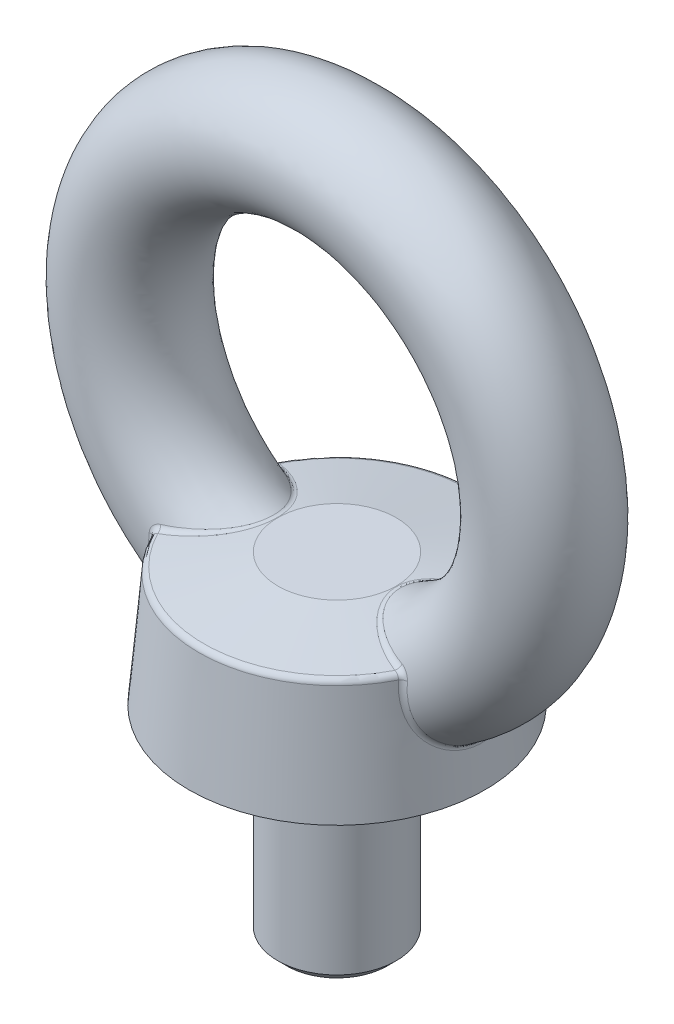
from build123d import *

# Parameters (mm, degrees)
SKETCH2_R      = 5
FILLET1_R      = 0.5
SKETCH4_R      = 5
EXTRUDE1_DEPTH = 17
CHAMFER1_SIZE  = 0.75


with BuildPart() as part:
    # Sweep1: sweep along a path in Sketch1
    with BuildLine(Plane.XY) as sweep1_path:
        EllipticalCenterArc((0, 22.5), 22.5, 22.5, start_angle=0, arc_size=360, rotation=-90)
    # Sketch2 → Sweep1 (sweep)
    with BuildSketch(Plane(origin=(0, 0, 0), x_dir=(0, 0, -1), z_dir=(1, 0, 0))):
        with Locations((0, 5)):
            Circle(SKETCH2_R)
    sweep(path=sweep1_path.line)

    # Sketch3 → Revolve1 (revolve)
    with BuildSketch(Plane(origin=(0, 0, 0), x_dir=(0, 0, -1), z_dir=(1, 0, 0)), mode=Mode.PRIVATE) as revolve1_sk:
        Polygon((0, 0), (-12.5, 0), (-11.625113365, 10), (-5, 11.168186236), (0, 11.168186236), align=None)
    revolve(revolve1_sk.sketch.rotate(Axis((0, 11.168186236, 0), (0, -1, 0)), 114.758666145), axis=Axis((0, 11.168186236, 0), (0, -1, 0)))

    # Fillet1
    fillet1_edges = [part.edges().sort_by_distance(p)[0] for p in [
        (5.199963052, 11.132927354, -1e-09),
        (12.162139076, 3.629464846, 0.703403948),
        (-5.799118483, 10.969607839, 1.974962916),
        (-12.126525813, 3.694465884, 1.105101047),
        (0, 10, -11.625113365),
        (0, 10, 11.625113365),
    ]]
    fillet(fillet1_edges, radius=FILLET1_R)

    # Sketch4 → Extrude1 (add)
    with BuildSketch(Plane.XZ):
        with Locations(Location((0, 0, 0), (0, 0, 270))):
            Circle(SKETCH4_R)
    extrude(amount=EXTRUDE1_DEPTH)

    # Chamfer1
    chamfer1_edges = [part.edges().sort_by_distance(p)[0] for p in [
        (0, -17, 5),
    ]]
    chamfer(chamfer1_edges, length=CHAMFER1_SIZE)

    # Sketch5 → Cut-Revolve1 (revolve, cut)
    with BuildSketch(Plane(origin=(0, 0, 0), x_dir=(0, 0, -1), z_dir=(1, 0, 0)), mode=Mode.PRIVATE) as cut_revolve1_sk:
        with BuildLine():
            Line((-5, 0), (-5, -2.049038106))
            Line((-5, -2.049038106), (-4.25, -0.75))
            Line((-4.25, -0.75), (-4.25, -0.375))
            ThreePointArc((-4.25, -0.375), (-4.359834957, -0.109834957), (-4.625, 0))
            Line((-4.625, 0), (-5, 0))
        make_face()
    revolve(cut_revolve1_sk.sketch.rotate(Axis((0, -17, 0), (0, 1, 0)), 180), axis=Axis((0, -17, 0), (0, 1, 0)), mode=Mode.SUBTRACT)


solid = part.part
